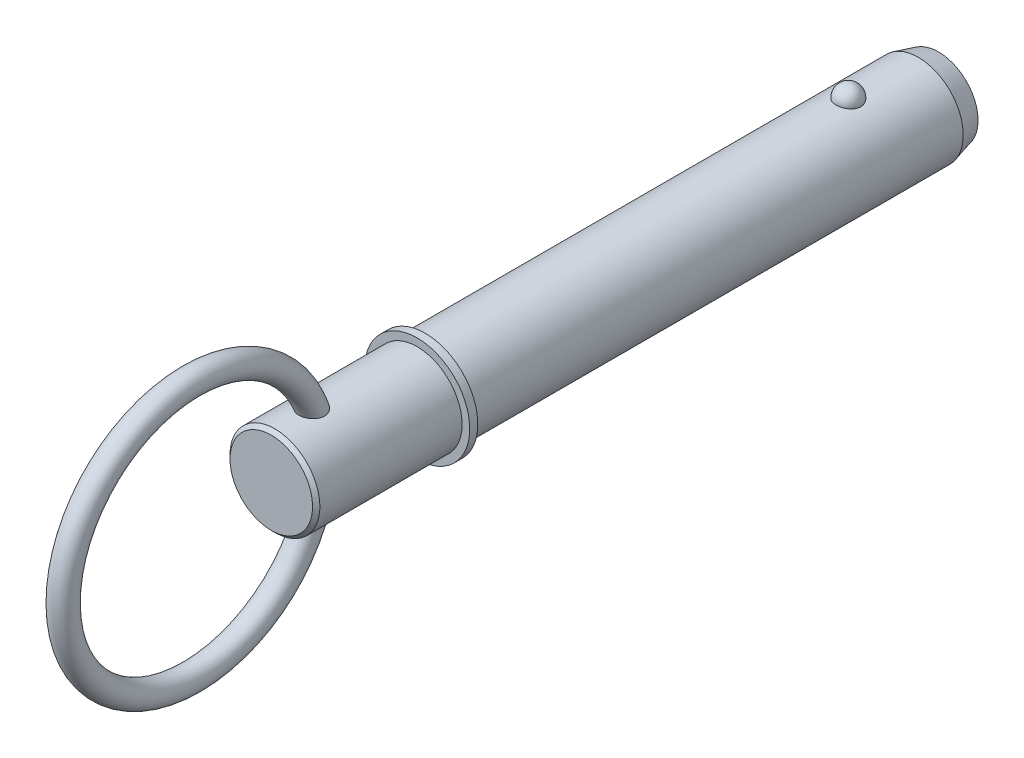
from build123d import *

# Parameters (mm, degrees)
SKETCH2_R           = 11.115
BOSS_EXTRUDE1_DEPTH = 101.6
BOSS_EXTRUDE2_START = 25.4
SKETCH3_R           = 11.115
BOSS_EXTRUDE2_DEPTH = 25.4
CHAMFER1_SIZE       = 5
CHAMFER1_SIZE2      = 1.339745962
SKETCH20_W          = 2
SKETCH20_H          = 13
SKETCH21_R          = 11.115
BOSS_EXTRUDE3_DEPTH = 38.1
CHAMFER2_SIZE       = 0.9
SKETCH24_R          = 3


with BuildPart() as part:
    # Sketch2 → Boss-Extrude1 (new body)
    with BuildSketch(Plane.XY):
        Circle(SKETCH2_R)
    extrude(amount=BOSS_EXTRUDE1_DEPTH)

    # Sketch3 → Boss-Extrude2 (add)
    with BuildSketch(Plane(origin=(0, 0, 0), x_dir=(-1, 0, 0), z_dir=(0, 0, -1)).offset(BOSS_EXTRUDE2_START)):
        Circle(SKETCH3_R)
    extrude(amount=-BOSS_EXTRUDE2_DEPTH)

    # Chamfer1
    chamfer1_edges = [part.edges().sort_by_distance(p)[0] for p in [
        (11.115, 0, -25.4),
    ]]
    chamfer1_side = [part.faces().sort_by_distance(p)[0] for p in [
        (11.115, 0, -12.7),
    ]]
    chamfer(chamfer1_edges, length=CHAMFER1_SIZE, length2=CHAMFER1_SIZE2, reference=chamfer1_side[0])

    # Sketch18 → Revolve1 (revolve)
    with BuildSketch(Plane(origin=(0, 0, 0), x_dir=(0, 0, -1), z_dir=(1, 0, 0))):
        with BuildLine():
            Line((3.07, 14.185), (3.07, 8.045))
            ThreePointArc((3.07, 8.045), (0, 11.115), (3.07, 14.185))
        make_face()
    revolve(axis=Axis((0, 14.185, -3.07), (0, -1, 0)))

    # Sketch20 → Revolve2 (revolve)
    with BuildSketch(Plane(origin=(0, 0, 0), x_dir=(0, 0, -1), z_dir=(1, 0, 0)), mode=Mode.PRIVATE) as revolve2_sk:
        with Locations((-102.6, 6.5)):
            Rectangle(SKETCH20_W, SKETCH20_H)
    revolve(revolve2_sk.sketch.rotate(Axis((0, 0, 33.728787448), (0, 0, 1)), 90), axis=Axis((0, 0, 33.728787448), (0, 0, 1)))

    # Sketch21 → Boss-Extrude3 (add)
    with BuildSketch(Plane(origin=(0, 0, 101.6), x_dir=(-1, 0, 0), z_dir=(0, 0, -1))):
        Circle(SKETCH21_R)
    extrude(amount=-BOSS_EXTRUDE3_DEPTH)

    # Chamfer2
    chamfer2_edges = [part.edges().sort_by_distance(p)[0] for p in [
        (11.115, 0, 139.7),
    ]]
    chamfer(chamfer2_edges, length=CHAMFER2_SIZE)

    # Sweep1: sweep along a path in Sketch23
    with BuildLine(Plane(origin=(0, 0, 0), x_dir=(0, 0, -1), z_dir=(1, 0, 0))) as sweep1_path:
        CenterArc((-159.45, 0), 31.75, 0, 360)
    # Sketch24 → Sweep1 (sweep)
    with BuildSketch(Plane(origin=(0, 0, 0), x_dir=(1, 0, 0), z_dir=(0, 1, 0))):
        with Locations((0, -127.7)):
            Circle(SKETCH24_R)
    sweep(path=sweep1_path.line)


solid = part.part
